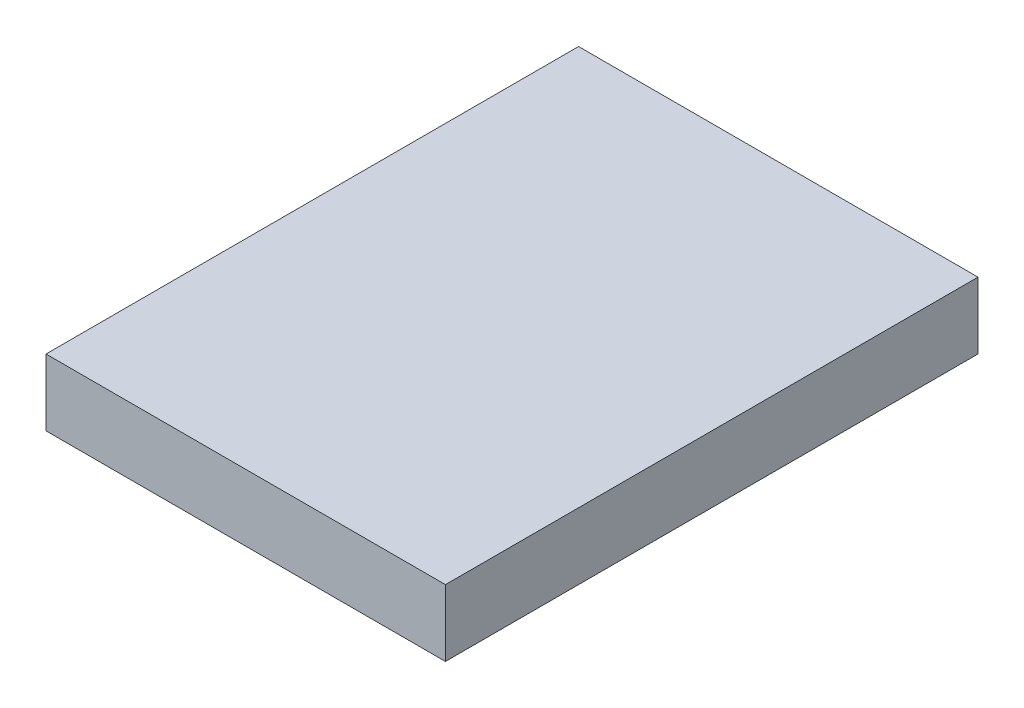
from build123d import *

# Parameters (mm, degrees)
ESQUISSE1_W      = 30
ESQUISSE1_H      = 5
EXTRUSION1_DEPTH = 20


with BuildPart() as part:
    # Esquisse1 → Extrusion1 (new, symmetric)
    with BuildSketch(Plane.XY):
        Rectangle(ESQUISSE1_W, ESQUISSE1_H)
    extrude(amount=EXTRUSION1_DEPTH, both=True)


solid = part.part
